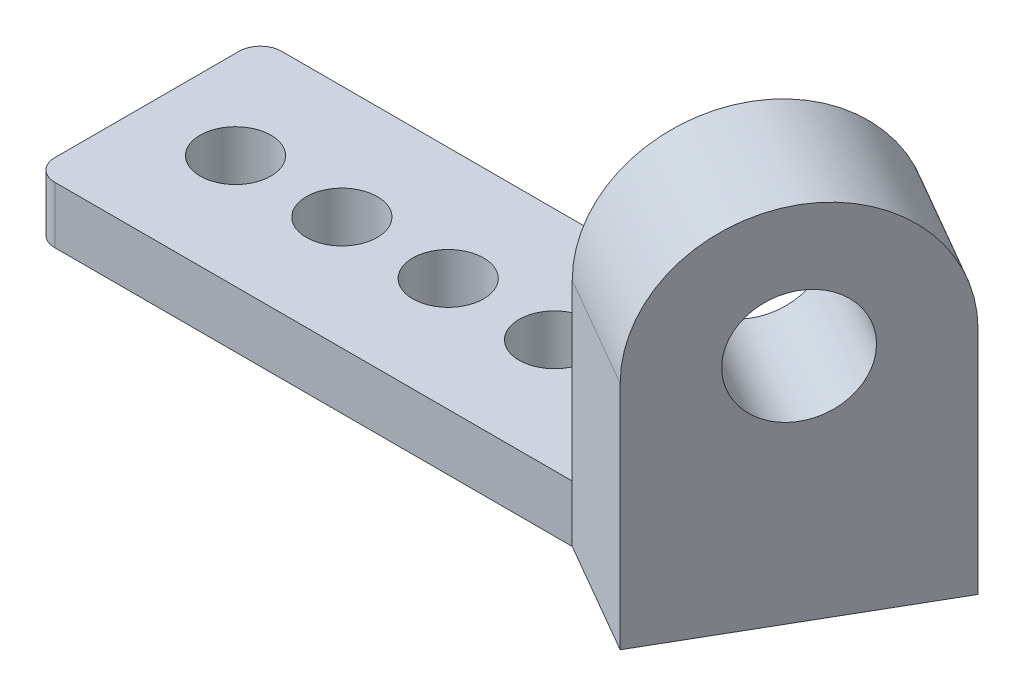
ISO-10303-21;
HEADER;
FILE_DESCRIPTION(('STEP AP214'),'2;1');
FILE_NAME('part.step','',(''),(''),'','','');
FILE_SCHEMA(('AUTOMOTIVE_DESIGN { 1 0 10303 214 1 1 1 1 }'));
ENDSEC;
DATA;
#1=APPLICATION_CONTEXT('core data for automotive mechanical design processes');
#2=APPLICATION_PROTOCOL_DEFINITION('international standard','automotive_design',2000,#1);
#3=PRODUCT_CONTEXT('',#1,'mechanical');
#4=PRODUCT('Part','Part','',(#3));
#5=PRODUCT_RELATED_PRODUCT_CATEGORY('part','',(#4));
#6=PRODUCT_DEFINITION_FORMATION('','',#4);
#7=PRODUCT_DEFINITION_CONTEXT('part definition',#1,'design');
#8=PRODUCT_DEFINITION('design','',#6,#7);
#9=PRODUCT_DEFINITION_SHAPE('','',#8);
#10=(LENGTH_UNIT() NAMED_UNIT(*) SI_UNIT(.MILLI.,.METRE.));
#11=(NAMED_UNIT(*) PLANE_ANGLE_UNIT() SI_UNIT($,.RADIAN.));
#12=(NAMED_UNIT(*) SI_UNIT($,.STERADIAN.) SOLID_ANGLE_UNIT());
#13=UNCERTAINTY_MEASURE_WITH_UNIT(LENGTH_MEASURE(1.E-05),#10,'distance_accuracy_value','');
#14=(GEOMETRIC_REPRESENTATION_CONTEXT(3) GLOBAL_UNCERTAINTY_ASSIGNED_CONTEXT((#13)) GLOBAL_UNIT_ASSIGNED_CONTEXT((#10,
#11,#12)) REPRESENTATION_CONTEXT('',''));
#15=CARTESIAN_POINT('',(0.,0.,0.));
#16=DIRECTION('',(0.,0.,1.));
#17=DIRECTION('',(1.,0.,0.));
#18=AXIS2_PLACEMENT_3D('',#15,#16,#17);
#19=CARTESIAN_POINT('',(152.,123.500325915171,0.));
#20=DIRECTION('',(-0.499999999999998,0.,0.86602540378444));
#21=DIRECTION('',(0.86602540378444,0.,0.499999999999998));
#22=AXIS2_PLACEMENT_3D('',#19,#20,#21);
#23=PLANE('',#22);
#24=DIRECTION('',(0.,-1.,0.));
#25=VECTOR('',#24,1.);
#26=CARTESIAN_POINT('',(184.,123.500325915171,18.4752086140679));
#27=LINE('',#26,#25);
#28=CARTESIAN_POINT('',(184.,65.049582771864,18.4752086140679));
#29=VERTEX_POINT('',#28);
#30=CARTESIAN_POINT('',(184.,0.,18.4752086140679));
#31=VERTEX_POINT('',#30);
#32=EDGE_CURVE('E126',#29,#31,#27,.T.);
#33=ORIENTED_EDGE('',*,*,#32,.F.);
#34=DIRECTION('',(-0.866025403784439,0.,-0.499999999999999));
#35=VECTOR('',#34,1.);
#36=CARTESIAN_POINT('',(184.,65.049582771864,18.4752086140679));
#37=LINE('',#36,#35);
#38=CARTESIAN_POINT('',(152.,65.049582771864,0.));
#39=VERTEX_POINT('',#38);
#40=EDGE_CURVE('E108',#29,#39,#37,.T.);
#41=ORIENTED_EDGE('',*,*,#40,.T.);
#42=DIRECTION('',(0.,-1.,0.));
#43=VECTOR('',#42,1.);
#44=CARTESIAN_POINT('',(152.,102.,0.));
#45=LINE('',#44,#43);
#46=CARTESIAN_POINT('',(152.,16.,0.));
#47=VERTEX_POINT('',#46);
#48=EDGE_CURVE('E112',#39,#47,#45,.T.);
#49=ORIENTED_EDGE('',*,*,#48,.T.);
#50=DIRECTION('',(0.,-1.,0.));
#51=VECTOR('',#50,1.);
#52=CARTESIAN_POINT('',(152.,16.,0.));
#53=LINE('',#52,#51);
#54=CARTESIAN_POINT('',(152.,0.,0.));
#55=VERTEX_POINT('',#54);
#56=EDGE_CURVE('E165',#47,#55,#53,.T.);
#57=ORIENTED_EDGE('',*,*,#56,.T.);
#58=DIRECTION('',(-0.86602540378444,0.,-0.499999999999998));
#59=VECTOR('',#58,1.);
#60=CARTESIAN_POINT('',(152.,0.,0.));
#61=LINE('',#60,#59);
#62=EDGE_CURVE('E144',#31,#55,#61,.T.);
#63=ORIENTED_EDGE('',*,*,#62,.F.);
#64=EDGE_LOOP('',(#33,#41,#49,#57,#63));
#65=FACE_BOUND('',#64,.T.);
#66=ADVANCED_FACE('F28',(#65),#23,.T.);
#67=CARTESIAN_POINT('',(184.,123.500325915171,18.4752086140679));
#68=DIRECTION('',(0.86602540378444,0.,0.499999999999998));
#69=DIRECTION('',(0.499999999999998,0.,-0.86602540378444));
#70=AXIS2_PLACEMENT_3D('',#67,#68,#69);
#71=PLANE('',#70);
#72=CARTESIAN_POINT('',(202.475208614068,65.049582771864,-13.5247913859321));
#73=DIRECTION('',(0.866025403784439,0.,0.499999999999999));
#74=DIRECTION('',(0.499999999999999,0.,-0.866025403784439));
#75=AXIS2_PLACEMENT_3D('',#72,#73,#74);
#76=CIRCLE('',#75,16.);
#77=CARTESIAN_POINT('',(210.475208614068,65.049582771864,-27.3811978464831));
#78=VERTEX_POINT('',#77);
#79=EDGE_CURVE('E132',#78,#78,#76,.T.);
#80=ORIENTED_EDGE('',*,*,#79,.F.);
#81=EDGE_LOOP('',(#80));
#82=FACE_BOUND('',#81,.T.);
#83=DIRECTION('',(0.,-1.,0.));
#84=VECTOR('',#83,1.);
#85=CARTESIAN_POINT('',(220.950417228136,123.500325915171,-45.5247913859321));
#86=LINE('',#85,#84);
#87=CARTESIAN_POINT('',(220.950417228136,65.049582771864,-45.5247913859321));
#88=VERTEX_POINT('',#87);
#89=CARTESIAN_POINT('',(220.950417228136,0.,-45.5247913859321));
#90=VERTEX_POINT('',#89);
#91=EDGE_CURVE('E150',#88,#90,#86,.T.);
#92=ORIENTED_EDGE('',*,*,#91,.F.);
#93=CARTESIAN_POINT('',(202.475208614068,65.049582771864,-13.5247913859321));
#94=DIRECTION('',(-0.866025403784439,0.,-0.499999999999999));
#95=DIRECTION('',(-0.499999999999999,0.,0.866025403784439));
#96=AXIS2_PLACEMENT_3D('',#93,#94,#95);
#97=CIRCLE('',#96,36.950417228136);
#98=EDGE_CURVE('E127',#29,#88,#97,.T.);
#99=ORIENTED_EDGE('',*,*,#98,.F.);
#100=ORIENTED_EDGE('',*,*,#32,.T.);
#101=DIRECTION('',(-0.499999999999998,0.,0.86602540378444));
#102=VECTOR('',#101,1.);
#103=CARTESIAN_POINT('',(184.,0.,18.4752086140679));
#104=LINE('',#103,#102);
#105=EDGE_CURVE('E141',#90,#31,#104,.T.);
#106=ORIENTED_EDGE('',*,*,#105,.F.);
#107=EDGE_LOOP('',(#92,#99,#100,#106));
#108=FACE_BOUND('',#107,.T.);
#109=ADVANCED_FACE('F211',(#82,#108),#71,.T.);
#110=CARTESIAN_POINT('',(152.,102.,0.));
#111=DIRECTION('',(0.86602540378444,0.,0.499999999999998));
#112=DIRECTION('',(0.499999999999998,0.,-0.86602540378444));
#113=AXIS2_PLACEMENT_3D('',#110,#111,#112);
#114=PLANE('',#113);
#115=CARTESIAN_POINT('',(170.475208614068,65.049582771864,-32.0000000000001));
#116=DIRECTION('',(0.86602540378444,0.,0.499999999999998));
#117=DIRECTION('',(0.499999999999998,0.,-0.86602540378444));
#118=AXIS2_PLACEMENT_3D('',#115,#116,#117);
#119=CIRCLE('',#118,16.);
#120=CARTESIAN_POINT('',(178.475208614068,65.049582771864,-45.8564064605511));
#121=VERTEX_POINT('',#120);
#122=EDGE_CURVE('E128',#121,#121,#119,.T.);
#123=ORIENTED_EDGE('',*,*,#122,.T.);
#124=EDGE_LOOP('',(#123));
#125=FACE_BOUND('',#124,.T.);
#126=CARTESIAN_POINT('',(170.475208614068,65.049582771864,-32.0000000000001));
#127=DIRECTION('',(0.86602540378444,0.,0.499999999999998));
#128=DIRECTION('',(0.499999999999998,0.,-0.86602540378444));
#129=AXIS2_PLACEMENT_3D('',#126,#127,#128);
#130=CIRCLE('',#129,36.950417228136);
#131=CARTESIAN_POINT('',(188.950417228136,65.049582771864,-64.));
#132=VERTEX_POINT('',#131);
#133=EDGE_CURVE('E103',#132,#39,#130,.T.);
#134=ORIENTED_EDGE('',*,*,#133,.F.);
#135=DIRECTION('',(0.,-1.,0.));
#136=VECTOR('',#135,1.);
#137=CARTESIAN_POINT('',(188.950417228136,102.,-64.));
#138=LINE('',#137,#136);
#139=CARTESIAN_POINT('',(188.950417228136,16.,-64.));
#140=VERTEX_POINT('',#139);
#141=EDGE_CURVE('E122',#132,#140,#138,.T.);
#142=ORIENTED_EDGE('',*,*,#141,.T.);
#143=DIRECTION('',(-0.499999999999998,0.,0.86602540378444));
#144=VECTOR('',#143,1.);
#145=CARTESIAN_POINT('',(141.712812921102,16.,17.817930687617));
#146=LINE('',#145,#144);
#147=EDGE_CURVE('E118',#140,#47,#146,.T.);
#148=ORIENTED_EDGE('',*,*,#147,.T.);
#149=ORIENTED_EDGE('',*,*,#48,.F.);
#150=EDGE_LOOP('',(#134,#142,#148,#149));
#151=FACE_BOUND('',#150,.T.);
#152=ADVANCED_FACE('F116',(#125,#151),#114,.F.);
#153=CARTESIAN_POINT('',(0.,16.,-64.));
#154=DIRECTION('',(0.,-1.,0.));
#155=DIRECTION('',(0.,0.,-1.));
#156=AXIS2_PLACEMENT_3D('',#153,#154,#155);
#157=PLANE('',#156);
#158=CARTESIAN_POINT('',(55.,15.9999999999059,-32.));
#159=DIRECTION('',(0.,1.,0.));
#160=DIRECTION('',(0.,0.,1.));
#161=AXIS2_PLACEMENT_3D('',#158,#159,#160);
#162=CIRCLE('',#161,10.);
#163=CARTESIAN_POINT('',(55.,15.9999999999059,-22.));
#164=VERTEX_POINT('',#163);
#165=EDGE_CURVE('E376',#164,#164,#162,.T.);
#166=ORIENTED_EDGE('',*,*,#165,.F.);
#167=EDGE_LOOP('',(#166));
#168=FACE_BOUND('',#167,.T.);
#169=CARTESIAN_POINT('',(25.,15.9999999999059,-32.));
#170=DIRECTION('',(0.,1.,0.));
#171=DIRECTION('',(0.,0.,1.));
#172=AXIS2_PLACEMENT_3D('',#169,#170,#171);
#173=CIRCLE('',#172,10.);
#174=CARTESIAN_POINT('',(25.,15.9999999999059,-22.));
#175=VERTEX_POINT('',#174);
#176=EDGE_CURVE('E371',#175,#175,#173,.T.);
#177=ORIENTED_EDGE('',*,*,#176,.F.);
#178=EDGE_LOOP('',(#177));
#179=FACE_BOUND('',#178,.T.);
#180=DIRECTION('',(0.,0.,1.));
#181=VECTOR('',#180,1.);
#182=CARTESIAN_POINT('',(0.,16.,0.));
#183=LINE('',#182,#181);
#184=CARTESIAN_POINT('',(0.,16.,-58.));
#185=VERTEX_POINT('',#184);
#186=CARTESIAN_POINT('',(0.,16.,-6.));
#187=VERTEX_POINT('',#186);
#188=EDGE_CURVE('E159',#185,#187,#183,.T.);
#189=ORIENTED_EDGE('',*,*,#188,.T.);
#190=CARTESIAN_POINT('',(6.,16.,-6.));
#191=DIRECTION('',(0.,-1.,0.));
#192=DIRECTION('',(0.,0.,-1.));
#193=AXIS2_PLACEMENT_3D('',#190,#191,#192);
#194=CIRCLE('',#193,6.);
#195=CARTESIAN_POINT('',(6.,16.,0.));
#196=VERTEX_POINT('',#195);
#197=EDGE_CURVE('E180',#187,#196,#194,.F.);
#198=ORIENTED_EDGE('',*,*,#197,.T.);
#199=DIRECTION('',(1.,0.,0.));
#200=VECTOR('',#199,1.);
#201=CARTESIAN_POINT('',(0.,16.,0.));
#202=LINE('',#201,#200);
#203=EDGE_CURVE('E161',#196,#47,#202,.T.);
#204=ORIENTED_EDGE('',*,*,#203,.T.);
#205=ORIENTED_EDGE('',*,*,#147,.F.);
#206=DIRECTION('',(-1.,0.,0.));
#207=VECTOR('',#206,1.);
#208=CARTESIAN_POINT('',(0.,16.,-64.));
#209=LINE('',#208,#207);
#210=CARTESIAN_POINT('',(6.,16.,-64.));
#211=VERTEX_POINT('',#210);
#212=EDGE_CURVE('E163',#140,#211,#209,.T.);
#213=ORIENTED_EDGE('',*,*,#212,.T.);
#214=CARTESIAN_POINT('',(6.,16.,-58.));
#215=DIRECTION('',(0.,-1.,0.));
#216=DIRECTION('',(0.,0.,-1.));
#217=AXIS2_PLACEMENT_3D('',#214,#215,#216);
#218=CIRCLE('',#217,6.);
#219=EDGE_CURVE('E178',#211,#185,#218,.F.);
#220=ORIENTED_EDGE('',*,*,#219,.T.);
#221=EDGE_LOOP('',(#189,#198,#204,#205,#213,#220));
#222=FACE_BOUND('',#221,.T.);
#223=CARTESIAN_POINT('',(85.,15.9999999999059,-32.));
#224=DIRECTION('',(0.,1.,0.));
#225=DIRECTION('',(0.,0.,1.));
#226=AXIS2_PLACEMENT_3D('',#223,#224,#225);
#227=CIRCLE('',#226,10.);
#228=CARTESIAN_POINT('',(85.,15.9999999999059,-22.));
#229=VERTEX_POINT('',#228);
#230=EDGE_CURVE('E186',#229,#229,#227,.T.);
#231=ORIENTED_EDGE('',*,*,#230,.F.);
#232=EDGE_LOOP('',(#231));
#233=FACE_BOUND('',#232,.T.);
#234=CARTESIAN_POINT('',(115.,15.9999999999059,-32.));
#235=DIRECTION('',(0.,1.,0.));
#236=DIRECTION('',(0.,0.,1.));
#237=AXIS2_PLACEMENT_3D('',#234,#235,#236);
#238=CIRCLE('',#237,10.);
#239=CARTESIAN_POINT('',(115.,15.9999999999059,-22.));
#240=VERTEX_POINT('',#239);
#241=EDGE_CURVE('E11',#240,#240,#238,.T.);
#242=ORIENTED_EDGE('',*,*,#241,.F.);
#243=EDGE_LOOP('',(#242));
#244=FACE_BOUND('',#243,.T.);
#245=ADVANCED_FACE('F198',(#168,#179,#222,#233,#244),#157,.F.);
#246=CARTESIAN_POINT('',(0.,16.,0.));
#247=DIRECTION('',(1.,0.,0.));
#248=DIRECTION('',(0.,0.,-1.));
#249=AXIS2_PLACEMENT_3D('',#246,#247,#248);
#250=PLANE('',#249);
#251=DIRECTION('',(0.,0.,1.));
#252=VECTOR('',#251,1.);
#253=CARTESIAN_POINT('',(0.,0.,0.));
#254=LINE('',#253,#252);
#255=CARTESIAN_POINT('',(0.,0.,-58.));
#256=VERTEX_POINT('',#255);
#257=CARTESIAN_POINT('',(0.,0.,-6.));
#258=VERTEX_POINT('',#257);
#259=EDGE_CURVE('E149',#256,#258,#254,.T.);
#260=ORIENTED_EDGE('',*,*,#259,.T.);
#261=DIRECTION('',(0.,-1.,0.));
#262=VECTOR('',#261,1.);
#263=CARTESIAN_POINT('',(0.,16.,-6.));
#264=LINE('',#263,#262);
#265=EDGE_CURVE('E51',#258,#187,#264,.F.);
#266=ORIENTED_EDGE('',*,*,#265,.T.);
#267=ORIENTED_EDGE('',*,*,#188,.F.);
#268=DIRECTION('',(0.,-1.,0.));
#269=VECTOR('',#268,1.);
#270=CARTESIAN_POINT('',(0.,16.,-58.));
#271=LINE('',#270,#269);
#272=EDGE_CURVE('E174',#185,#256,#271,.T.);
#273=ORIENTED_EDGE('',*,*,#272,.T.);
#274=EDGE_LOOP('',(#260,#266,#267,#273));
#275=FACE_BOUND('',#274,.T.);
#276=ADVANCED_FACE('F200',(#275),#250,.F.);
#277=CARTESIAN_POINT('',(0.,16.,0.));
#278=DIRECTION('',(0.,0.,-1.));
#279=DIRECTION('',(-1.,0.,0.));
#280=AXIS2_PLACEMENT_3D('',#277,#278,#279);
#281=PLANE('',#280);
#282=ORIENTED_EDGE('',*,*,#203,.F.);
#283=DIRECTION('',(0.,-1.,0.));
#284=VECTOR('',#283,1.);
#285=CARTESIAN_POINT('',(6.,16.,0.));
#286=LINE('',#285,#284);
#287=CARTESIAN_POINT('',(6.,0.,0.));
#288=VERTEX_POINT('',#287);
#289=EDGE_CURVE('E166',#196,#288,#286,.T.);
#290=ORIENTED_EDGE('',*,*,#289,.T.);
#291=DIRECTION('',(1.,0.,0.));
#292=VECTOR('',#291,1.);
#293=CARTESIAN_POINT('',(0.,0.,0.));
#294=LINE('',#293,#292);
#295=EDGE_CURVE('E155',#288,#55,#294,.T.);
#296=ORIENTED_EDGE('',*,*,#295,.T.);
#297=ORIENTED_EDGE('',*,*,#56,.F.);
#298=EDGE_LOOP('',(#282,#290,#296,#297));
#299=FACE_BOUND('',#298,.T.);
#300=ADVANCED_FACE('F208',(#299),#281,.F.);
#301=CARTESIAN_POINT('',(0.,16.,-64.));
#302=DIRECTION('',(0.,0.,1.));
#303=DIRECTION('',(1.,0.,0.));
#304=AXIS2_PLACEMENT_3D('',#301,#302,#303);
#305=PLANE('',#304);
#306=DIRECTION('',(-1.,0.,0.));
#307=VECTOR('',#306,1.);
#308=CARTESIAN_POINT('',(0.,0.,-64.));
#309=LINE('',#308,#307);
#310=CARTESIAN_POINT('',(188.950417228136,0.,-64.));
#311=VERTEX_POINT('',#310);
#312=CARTESIAN_POINT('',(6.,0.,-64.));
#313=VERTEX_POINT('',#312);
#314=EDGE_CURVE('E157',#311,#313,#309,.T.);
#315=ORIENTED_EDGE('',*,*,#314,.T.);
#316=DIRECTION('',(0.,-1.,0.));
#317=VECTOR('',#316,1.);
#318=CARTESIAN_POINT('',(6.,16.,-64.));
#319=LINE('',#318,#317);
#320=EDGE_CURVE('E43',#313,#211,#319,.F.);
#321=ORIENTED_EDGE('',*,*,#320,.T.);
#322=ORIENTED_EDGE('',*,*,#212,.F.);
#323=DIRECTION('',(0.,-1.,0.));
#324=VECTOR('',#323,1.);
#325=CARTESIAN_POINT('',(188.950417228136,123.500325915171,-64.));
#326=LINE('',#325,#324);
#327=EDGE_CURVE('E147',#140,#311,#326,.T.);
#328=ORIENTED_EDGE('',*,*,#327,.T.);
#329=EDGE_LOOP('',(#315,#321,#322,#328));
#330=FACE_BOUND('',#329,.T.);
#331=ADVANCED_FACE('F230',(#330),#305,.F.);
#332=CARTESIAN_POINT('',(0.,0.,-64.));
#333=DIRECTION('',(0.,-1.,0.));
#334=DIRECTION('',(0.,0.,-1.));
#335=AXIS2_PLACEMENT_3D('',#332,#333,#334);
#336=PLANE('',#335);
#337=CARTESIAN_POINT('',(55.,0.,-32.));
#338=DIRECTION('',(0.,1.,0.));
#339=DIRECTION('',(0.,0.,1.));
#340=AXIS2_PLACEMENT_3D('',#337,#338,#339);
#341=CIRCLE('',#340,10.);
#342=CARTESIAN_POINT('',(55.,0.,-22.));
#343=VERTEX_POINT('',#342);
#344=EDGE_CURVE('E239',#343,#343,#341,.T.);
#345=ORIENTED_EDGE('',*,*,#344,.T.);
#346=EDGE_LOOP('',(#345));
#347=FACE_BOUND('',#346,.T.);
#348=CARTESIAN_POINT('',(25.,0.,-32.));
#349=DIRECTION('',(0.,1.,0.));
#350=DIRECTION('',(0.,0.,1.));
#351=AXIS2_PLACEMENT_3D('',#348,#349,#350);
#352=CIRCLE('',#351,10.);
#353=CARTESIAN_POINT('',(25.,0.,-22.));
#354=VERTEX_POINT('',#353);
#355=EDGE_CURVE('E243',#354,#354,#352,.T.);
#356=ORIENTED_EDGE('',*,*,#355,.T.);
#357=EDGE_LOOP('',(#356));
#358=FACE_BOUND('',#357,.T.);
#359=ORIENTED_EDGE('',*,*,#295,.F.);
#360=CARTESIAN_POINT('',(6.,0.,-6.));
#361=DIRECTION('',(0.,-1.,0.));
#362=DIRECTION('',(0.,0.,-1.));
#363=AXIS2_PLACEMENT_3D('',#360,#361,#362);
#364=CIRCLE('',#363,6.);
#365=EDGE_CURVE('E172',#288,#258,#364,.T.);
#366=ORIENTED_EDGE('',*,*,#365,.T.);
#367=ORIENTED_EDGE('',*,*,#259,.F.);
#368=CARTESIAN_POINT('',(6.,0.,-58.));
#369=DIRECTION('',(0.,-1.,0.));
#370=DIRECTION('',(0.,0.,-1.));
#371=AXIS2_PLACEMENT_3D('',#368,#369,#370);
#372=CIRCLE('',#371,6.);
#373=EDGE_CURVE('E170',#256,#313,#372,.T.);
#374=ORIENTED_EDGE('',*,*,#373,.T.);
#375=ORIENTED_EDGE('',*,*,#314,.F.);
#376=DIRECTION('',(0.86602540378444,0.,0.499999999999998));
#377=VECTOR('',#376,1.);
#378=CARTESIAN_POINT('',(220.950417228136,0.,-45.5247913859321));
#379=LINE('',#378,#377);
#380=EDGE_CURVE('E138',#311,#90,#379,.T.);
#381=ORIENTED_EDGE('',*,*,#380,.T.);
#382=ORIENTED_EDGE('',*,*,#105,.T.);
#383=ORIENTED_EDGE('',*,*,#62,.T.);
#384=EDGE_LOOP('',(#359,#366,#367,#374,#375,#381,#382,#383));
#385=FACE_BOUND('',#384,.T.);
#386=CARTESIAN_POINT('',(85.,0.,-32.));
#387=DIRECTION('',(0.,1.,0.));
#388=DIRECTION('',(0.,0.,1.));
#389=AXIS2_PLACEMENT_3D('',#386,#387,#388);
#390=CIRCLE('',#389,10.);
#391=CARTESIAN_POINT('',(85.,0.,-22.));
#392=VERTEX_POINT('',#391);
#393=EDGE_CURVE('E183',#392,#392,#390,.T.);
#394=ORIENTED_EDGE('',*,*,#393,.T.);
#395=EDGE_LOOP('',(#394));
#396=FACE_BOUND('',#395,.T.);
#397=CARTESIAN_POINT('',(115.,0.,-32.));
#398=DIRECTION('',(0.,1.,0.));
#399=DIRECTION('',(0.,0.,1.));
#400=AXIS2_PLACEMENT_3D('',#397,#398,#399);
#401=CIRCLE('',#400,10.);
#402=CARTESIAN_POINT('',(115.,0.,-22.));
#403=VERTEX_POINT('',#402);
#404=EDGE_CURVE('E36',#403,#403,#401,.T.);
#405=ORIENTED_EDGE('',*,*,#404,.T.);
#406=EDGE_LOOP('',(#405));
#407=FACE_BOUND('',#406,.T.);
#408=ADVANCED_FACE('F191',(#347,#358,#385,#396,#407),#336,.T.);
#409=CARTESIAN_POINT('',(220.950417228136,123.500325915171,-45.5247913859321));
#410=DIRECTION('',(0.499999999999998,0.,-0.86602540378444));
#411=DIRECTION('',(-0.86602540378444,0.,-0.499999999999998));
#412=AXIS2_PLACEMENT_3D('',#409,#410,#411);
#413=PLANE('',#412);
#414=DIRECTION('',(-0.866025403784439,0.,-0.499999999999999));
#415=VECTOR('',#414,1.);
#416=CARTESIAN_POINT('',(220.950417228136,65.049582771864,-45.5247913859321));
#417=LINE('',#416,#415);
#418=EDGE_CURVE('E109',#88,#132,#417,.T.);
#419=ORIENTED_EDGE('',*,*,#418,.F.);
#420=ORIENTED_EDGE('',*,*,#91,.T.);
#421=ORIENTED_EDGE('',*,*,#380,.F.);
#422=ORIENTED_EDGE('',*,*,#327,.F.);
#423=ORIENTED_EDGE('',*,*,#141,.F.);
#424=EDGE_LOOP('',(#419,#420,#421,#422,#423));
#425=FACE_BOUND('',#424,.T.);
#426=ADVANCED_FACE('F228',(#425),#413,.T.);
#427=CARTESIAN_POINT('',(202.475208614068,65.049582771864,-13.5247913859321));
#428=DIRECTION('',(-0.866025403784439,0.,-0.499999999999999));
#429=DIRECTION('',(-0.499999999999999,0.,0.866025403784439));
#430=AXIS2_PLACEMENT_3D('',#427,#428,#429);
#431=CYLINDRICAL_SURFACE('',#430,36.950417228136);
#432=ORIENTED_EDGE('',*,*,#418,.T.);
#433=ORIENTED_EDGE('',*,*,#133,.T.);
#434=ORIENTED_EDGE('',*,*,#40,.F.);
#435=ORIENTED_EDGE('',*,*,#98,.T.);
#436=EDGE_LOOP('',(#432,#433,#434,#435));
#437=FACE_BOUND('',#436,.T.);
#438=ADVANCED_FACE('F105',(#437),#431,.T.);
#439=CARTESIAN_POINT('',(28.7623956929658,65.049582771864,-113.817930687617));
#440=DIRECTION('',(0.866025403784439,0.,0.499999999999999));
#441=DIRECTION('',(0.499999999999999,0.,-0.866025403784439));
#442=AXIS2_PLACEMENT_3D('',#439,#440,#441);
#443=CYLINDRICAL_SURFACE('',#442,16.);
#444=ORIENTED_EDGE('',*,*,#79,.T.);
#445=EDGE_LOOP('',(#444));
#446=FACE_BOUND('',#445,.T.);
#447=ORIENTED_EDGE('',*,*,#122,.F.);
#448=EDGE_LOOP('',(#447));
#449=FACE_BOUND('',#448,.T.);
#450=ADVANCED_FACE('F287',(#446,#449),#443,.F.);
#451=CARTESIAN_POINT('',(25.,0.,-32.));
#452=DIRECTION('',(0.,1.,0.));
#453=DIRECTION('',(0.,0.,1.));
#454=AXIS2_PLACEMENT_3D('',#451,#452,#453);
#455=CYLINDRICAL_SURFACE('',#454,10.);
#456=ORIENTED_EDGE('',*,*,#355,.F.);
#457=EDGE_LOOP('',(#456));
#458=FACE_BOUND('',#457,.T.);
#459=ORIENTED_EDGE('',*,*,#176,.T.);
#460=EDGE_LOOP('',(#459));
#461=FACE_BOUND('',#460,.T.);
#462=ADVANCED_FACE('F282',(#458,#461),#455,.F.);
#463=CARTESIAN_POINT('',(6.,16.,-6.));
#464=DIRECTION('',(0.,-1.,0.));
#465=DIRECTION('',(0.,0.,-1.));
#466=AXIS2_PLACEMENT_3D('',#463,#464,#465);
#467=CYLINDRICAL_SURFACE('',#466,6.);
#468=ORIENTED_EDGE('',*,*,#197,.F.);
#469=ORIENTED_EDGE('',*,*,#265,.F.);
#470=ORIENTED_EDGE('',*,*,#365,.F.);
#471=ORIENTED_EDGE('',*,*,#289,.F.);
#472=EDGE_LOOP('',(#468,#469,#470,#471));
#473=FACE_BOUND('',#472,.T.);
#474=ADVANCED_FACE('F268',(#473),#467,.T.);
#475=CARTESIAN_POINT('',(6.,16.,-58.));
#476=DIRECTION('',(0.,-1.,0.));
#477=DIRECTION('',(0.,0.,-1.));
#478=AXIS2_PLACEMENT_3D('',#475,#476,#477);
#479=CYLINDRICAL_SURFACE('',#478,6.);
#480=ORIENTED_EDGE('',*,*,#219,.F.);
#481=ORIENTED_EDGE('',*,*,#320,.F.);
#482=ORIENTED_EDGE('',*,*,#373,.F.);
#483=ORIENTED_EDGE('',*,*,#272,.F.);
#484=EDGE_LOOP('',(#480,#481,#482,#483));
#485=FACE_BOUND('',#484,.T.);
#486=ADVANCED_FACE('F255',(#485),#479,.T.);
#487=CARTESIAN_POINT('',(55.,0.,-32.));
#488=DIRECTION('',(0.,1.,0.));
#489=DIRECTION('',(0.,0.,1.));
#490=AXIS2_PLACEMENT_3D('',#487,#488,#489);
#491=CYLINDRICAL_SURFACE('',#490,10.);
#492=ORIENTED_EDGE('',*,*,#344,.F.);
#493=EDGE_LOOP('',(#492));
#494=FACE_BOUND('',#493,.T.);
#495=ORIENTED_EDGE('',*,*,#165,.T.);
#496=EDGE_LOOP('',(#495));
#497=FACE_BOUND('',#496,.T.);
#498=ADVANCED_FACE('F250',(#494,#497),#491,.F.);
#499=CARTESIAN_POINT('',(85.,0.,-32.));
#500=DIRECTION('',(0.,1.,0.));
#501=DIRECTION('',(0.,0.,1.));
#502=AXIS2_PLACEMENT_3D('',#499,#500,#501);
#503=CYLINDRICAL_SURFACE('',#502,10.);
#504=ORIENTED_EDGE('',*,*,#393,.F.);
#505=EDGE_LOOP('',(#504));
#506=FACE_BOUND('',#505,.T.);
#507=ORIENTED_EDGE('',*,*,#230,.T.);
#508=EDGE_LOOP('',(#507));
#509=FACE_BOUND('',#508,.T.);
#510=ADVANCED_FACE('F195',(#506,#509),#503,.F.);
#511=CARTESIAN_POINT('',(115.,0.,-32.));
#512=DIRECTION('',(0.,1.,0.));
#513=DIRECTION('',(0.,0.,1.));
#514=AXIS2_PLACEMENT_3D('',#511,#512,#513);
#515=CYLINDRICAL_SURFACE('',#514,10.);
#516=ORIENTED_EDGE('',*,*,#404,.F.);
#517=EDGE_LOOP('',(#516));
#518=FACE_BOUND('',#517,.T.);
#519=ORIENTED_EDGE('',*,*,#241,.T.);
#520=EDGE_LOOP('',(#519));
#521=FACE_BOUND('',#520,.T.);
#522=ADVANCED_FACE('F30',(#518,#521),#515,.F.);
#523=CLOSED_SHELL('',(#66,#109,#152,#245,#276,#300,#331,#408,#426,#438,#450,#462,#474,#486,#498,
#510,#522));
#524=MANIFOLD_SOLID_BREP('B2',#523);
#525=ADVANCED_BREP_SHAPE_REPRESENTATION('',(#18,#524),#14);
#526=SHAPE_DEFINITION_REPRESENTATION(#9,#525);
ENDSEC;
END-ISO-10303-21;
